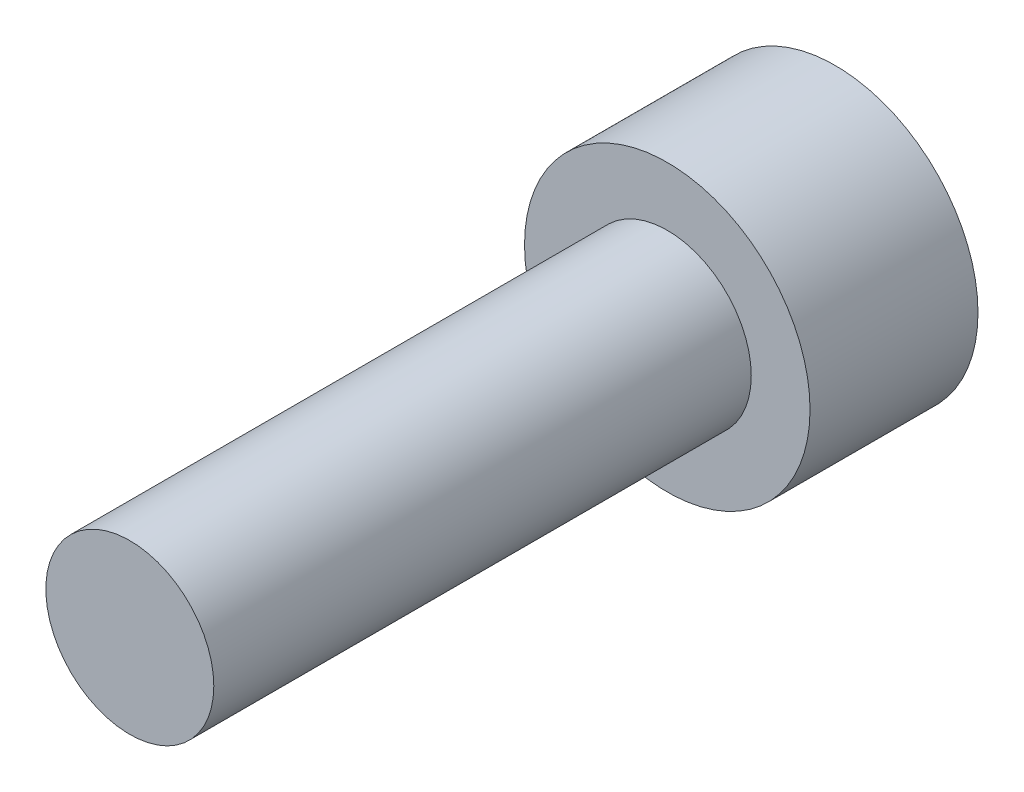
ISO-10303-21;
HEADER;
FILE_DESCRIPTION(('STEP AP214'),'2;1');
FILE_NAME('part.step','',(''),(''),'','','');
FILE_SCHEMA(('AUTOMOTIVE_DESIGN { 1 0 10303 214 1 1 1 1 }'));
ENDSEC;
DATA;
#1=APPLICATION_CONTEXT('core data for automotive mechanical design processes');
#2=APPLICATION_PROTOCOL_DEFINITION('international standard','automotive_design',2000,#1);
#3=PRODUCT_CONTEXT('',#1,'mechanical');
#4=PRODUCT('Part','Part','',(#3));
#5=PRODUCT_RELATED_PRODUCT_CATEGORY('part','',(#4));
#6=PRODUCT_DEFINITION_FORMATION('','',#4);
#7=PRODUCT_DEFINITION_CONTEXT('part definition',#1,'design');
#8=PRODUCT_DEFINITION('design','',#6,#7);
#9=PRODUCT_DEFINITION_SHAPE('','',#8);
#10=(LENGTH_UNIT() NAMED_UNIT(*) SI_UNIT(.MILLI.,.METRE.));
#11=(NAMED_UNIT(*) PLANE_ANGLE_UNIT() SI_UNIT($,.RADIAN.));
#12=(NAMED_UNIT(*) SI_UNIT($,.STERADIAN.) SOLID_ANGLE_UNIT());
#13=UNCERTAINTY_MEASURE_WITH_UNIT(LENGTH_MEASURE(1.E-05),#10,'distance_accuracy_value','');
#14=(GEOMETRIC_REPRESENTATION_CONTEXT(3) GLOBAL_UNCERTAINTY_ASSIGNED_CONTEXT((#13)) GLOBAL_UNIT_ASSIGNED_CONTEXT((#10,
#11,#12)) REPRESENTATION_CONTEXT('',''));
#15=CARTESIAN_POINT('',(0.,0.,0.));
#16=DIRECTION('',(0.,0.,1.));
#17=DIRECTION('',(1.,0.,0.));
#18=AXIS2_PLACEMENT_3D('',#15,#16,#17);
#19=CARTESIAN_POINT('',(0.,0.,16.));
#20=DIRECTION('',(0.,0.,1.));
#21=DIRECTION('',(1.,0.,0.));
#22=AXIS2_PLACEMENT_3D('',#19,#20,#21);
#23=PLANE('',#22);
#24=CARTESIAN_POINT('',(0.,0.,16.));
#25=DIRECTION('',(0.,0.,1.));
#26=DIRECTION('',(1.,0.,0.));
#27=AXIS2_PLACEMENT_3D('',#24,#25,#26);
#28=CIRCLE('',#27,2.5);
#29=CARTESIAN_POINT('',(2.5,0.,16.));
#30=VERTEX_POINT('',#29);
#31=EDGE_CURVE('E11',#30,#30,#28,.T.);
#32=ORIENTED_EDGE('',*,*,#31,.T.);
#33=EDGE_LOOP('',(#32));
#34=FACE_BOUND('',#33,.T.);
#35=ADVANCED_FACE('F32',(#34),#23,.T.);
#36=CARTESIAN_POINT('',(0.,0.,16.));
#37=DIRECTION('',(0.,0.,1.));
#38=DIRECTION('',(1.,0.,0.));
#39=AXIS2_PLACEMENT_3D('',#36,#37,#38);
#40=CYLINDRICAL_SURFACE('',#39,2.5);
#41=CARTESIAN_POINT('',(0.,0.,0.));
#42=DIRECTION('',(0.,0.,1.));
#43=DIRECTION('',(1.,0.,0.));
#44=AXIS2_PLACEMENT_3D('',#41,#42,#43);
#45=CIRCLE('',#44,2.5);
#46=CARTESIAN_POINT('',(2.5,0.,0.));
#47=VERTEX_POINT('',#46);
#48=EDGE_CURVE('E39',#47,#47,#45,.T.);
#49=ORIENTED_EDGE('',*,*,#48,.T.);
#50=EDGE_LOOP('',(#49));
#51=FACE_BOUND('',#50,.T.);
#52=ORIENTED_EDGE('',*,*,#31,.F.);
#53=EDGE_LOOP('',(#52));
#54=FACE_BOUND('',#53,.T.);
#55=ADVANCED_FACE('F146',(#51,#54),#40,.T.);
#56=CARTESIAN_POINT('',(0.,-2.5,0.));
#57=DIRECTION('',(0.,0.,1.));
#58=DIRECTION('',(1.,0.,0.));
#59=AXIS2_PLACEMENT_3D('',#56,#57,#58);
#60=PLANE('',#59);
#61=CARTESIAN_POINT('',(0.,0.,0.));
#62=DIRECTION('',(0.,0.,1.));
#63=DIRECTION('',(1.,0.,0.));
#64=AXIS2_PLACEMENT_3D('',#61,#62,#63);
#65=CIRCLE('',#64,4.25);
#66=CARTESIAN_POINT('',(4.25,0.,0.));
#67=VERTEX_POINT('',#66);
#68=EDGE_CURVE('E141',#67,#67,#65,.T.);
#69=ORIENTED_EDGE('',*,*,#68,.T.);
#70=EDGE_LOOP('',(#69));
#71=FACE_BOUND('',#70,.T.);
#72=ORIENTED_EDGE('',*,*,#48,.F.);
#73=EDGE_LOOP('',(#72));
#74=FACE_BOUND('',#73,.T.);
#75=ADVANCED_FACE('F149',(#71,#74),#60,.T.);
#76=CARTESIAN_POINT('',(0.,0.,16.));
#77=DIRECTION('',(0.,0.,1.));
#78=DIRECTION('',(1.,0.,0.));
#79=AXIS2_PLACEMENT_3D('',#76,#77,#78);
#80=CYLINDRICAL_SURFACE('',#79,4.25);
#81=CARTESIAN_POINT('',(0.,0.,-5.));
#82=DIRECTION('',(0.,0.,1.));
#83=DIRECTION('',(1.,0.,0.));
#84=AXIS2_PLACEMENT_3D('',#81,#82,#83);
#85=CIRCLE('',#84,4.25);
#86=CARTESIAN_POINT('',(4.25,0.,-5.));
#87=VERTEX_POINT('',#86);
#88=EDGE_CURVE('E133',#87,#87,#85,.T.);
#89=ORIENTED_EDGE('',*,*,#88,.T.);
#90=EDGE_LOOP('',(#89));
#91=FACE_BOUND('',#90,.T.);
#92=ORIENTED_EDGE('',*,*,#68,.F.);
#93=EDGE_LOOP('',(#92));
#94=FACE_BOUND('',#93,.T.);
#95=ADVANCED_FACE('F151',(#91,#94),#80,.T.);
#96=CARTESIAN_POINT('',(0.,-4.25,-5.));
#97=DIRECTION('',(0.,0.,-1.));
#98=DIRECTION('',(-1.,0.,0.));
#99=AXIS2_PLACEMENT_3D('',#96,#97,#98);
#100=PLANE('',#99);
#101=DIRECTION('',(0.866025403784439,-0.5,0.));
#102=VECTOR('',#101,1.);
#103=CARTESIAN_POINT('',(0.,2.3094010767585,-5.));
#104=LINE('',#103,#102);
#105=CARTESIAN_POINT('',(0.,2.3094010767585,-5.));
#106=VERTEX_POINT('',#105);
#107=CARTESIAN_POINT('',(2.,1.15470053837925,-5.));
#108=VERTEX_POINT('',#107);
#109=EDGE_CURVE('E46',#106,#108,#104,.T.);
#110=ORIENTED_EDGE('',*,*,#109,.F.);
#111=DIRECTION('',(0.866025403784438,0.5,0.));
#112=VECTOR('',#111,1.);
#113=CARTESIAN_POINT('',(-2.,1.15470053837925,-5.));
#114=LINE('',#113,#112);
#115=CARTESIAN_POINT('',(-2.,1.15470053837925,-5.));
#116=VERTEX_POINT('',#115);
#117=EDGE_CURVE('E129',#116,#106,#114,.T.);
#118=ORIENTED_EDGE('',*,*,#117,.F.);
#119=DIRECTION('',(0.,1.,0.));
#120=VECTOR('',#119,1.);
#121=CARTESIAN_POINT('',(-2.,-1.15470053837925,-5.));
#122=LINE('',#121,#120);
#123=CARTESIAN_POINT('',(-2.,-1.15470053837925,-5.));
#124=VERTEX_POINT('',#123);
#125=EDGE_CURVE('E127',#124,#116,#122,.T.);
#126=ORIENTED_EDGE('',*,*,#125,.F.);
#127=DIRECTION('',(-0.866025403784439,0.5,0.));
#128=VECTOR('',#127,1.);
#129=CARTESIAN_POINT('',(0.,-2.3094010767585,-5.));
#130=LINE('',#129,#128);
#131=CARTESIAN_POINT('',(0.,-2.3094010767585,-5.));
#132=VERTEX_POINT('',#131);
#133=EDGE_CURVE('E94',#132,#124,#130,.T.);
#134=ORIENTED_EDGE('',*,*,#133,.F.);
#135=DIRECTION('',(-0.866025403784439,-0.5,0.));
#136=VECTOR('',#135,1.);
#137=CARTESIAN_POINT('',(2.,-1.15470053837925,-5.));
#138=LINE('',#137,#136);
#139=CARTESIAN_POINT('',(2.,-1.15470053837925,-5.));
#140=VERTEX_POINT('',#139);
#141=EDGE_CURVE('E123',#140,#132,#138,.T.);
#142=ORIENTED_EDGE('',*,*,#141,.F.);
#143=DIRECTION('',(0.,-1.,0.));
#144=VECTOR('',#143,1.);
#145=CARTESIAN_POINT('',(2.,1.15470053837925,-5.));
#146=LINE('',#145,#144);
#147=EDGE_CURVE('E120',#108,#140,#146,.T.);
#148=ORIENTED_EDGE('',*,*,#147,.F.);
#149=EDGE_LOOP('',(#110,#118,#126,#134,#142,#148));
#150=FACE_BOUND('',#149,.T.);
#151=ORIENTED_EDGE('',*,*,#88,.F.);
#152=EDGE_LOOP('',(#151));
#153=FACE_BOUND('',#152,.T.);
#154=ADVANCED_FACE('F158',(#150,#153),#100,.T.);
#155=CARTESIAN_POINT('',(0.,2.3094010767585,-0.999999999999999));
#156=DIRECTION('',(0.5,0.866025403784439,0.));
#157=DIRECTION('',(-0.866025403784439,0.5,0.));
#158=AXIS2_PLACEMENT_3D('',#155,#156,#157);
#159=PLANE('',#158);
#160=ORIENTED_EDGE('',*,*,#109,.T.);
#161=DIRECTION('',(0.,0.,-1.));
#162=VECTOR('',#161,1.);
#163=CARTESIAN_POINT('',(2.,1.15470053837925,-0.999999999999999));
#164=LINE('',#163,#162);
#165=CARTESIAN_POINT('',(2.,1.15470053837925,-0.999999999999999));
#166=VERTEX_POINT('',#165);
#167=EDGE_CURVE('E76',#166,#108,#164,.T.);
#168=ORIENTED_EDGE('',*,*,#167,.F.);
#169=DIRECTION('',(0.866025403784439,-0.5,0.));
#170=VECTOR('',#169,1.);
#171=CARTESIAN_POINT('',(0.,2.3094010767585,-0.999999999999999));
#172=LINE('',#171,#170);
#173=CARTESIAN_POINT('',(0.,2.3094010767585,-0.999999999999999));
#174=VERTEX_POINT('',#173);
#175=EDGE_CURVE('E131',#174,#166,#172,.T.);
#176=ORIENTED_EDGE('',*,*,#175,.F.);
#177=DIRECTION('',(0.,0.,-1.));
#178=VECTOR('',#177,1.);
#179=CARTESIAN_POINT('',(0.,2.3094010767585,-0.999999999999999));
#180=LINE('',#179,#178);
#181=EDGE_CURVE('E54',#174,#106,#180,.T.);
#182=ORIENTED_EDGE('',*,*,#181,.T.);
#183=EDGE_LOOP('',(#160,#168,#176,#182));
#184=FACE_BOUND('',#183,.T.);
#185=ADVANCED_FACE('F189',(#184),#159,.F.);
#186=CARTESIAN_POINT('',(-2.,1.15470053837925,-0.999999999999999));
#187=DIRECTION('',(-0.5,0.866025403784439,0.));
#188=DIRECTION('',(-0.866025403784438,-0.5,0.));
#189=AXIS2_PLACEMENT_3D('',#186,#187,#188);
#190=PLANE('',#189);
#191=ORIENTED_EDGE('',*,*,#117,.T.);
#192=ORIENTED_EDGE('',*,*,#181,.F.);
#193=DIRECTION('',(0.866025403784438,0.5,0.));
#194=VECTOR('',#193,1.);
#195=CARTESIAN_POINT('',(-2.,1.15470053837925,-0.999999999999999));
#196=LINE('',#195,#194);
#197=CARTESIAN_POINT('',(-2.,1.15470053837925,-0.999999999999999));
#198=VERTEX_POINT('',#197);
#199=EDGE_CURVE('E106',#198,#174,#196,.T.);
#200=ORIENTED_EDGE('',*,*,#199,.F.);
#201=DIRECTION('',(0.,0.,-1.));
#202=VECTOR('',#201,1.);
#203=CARTESIAN_POINT('',(-2.,1.15470053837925,-0.999999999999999));
#204=LINE('',#203,#202);
#205=EDGE_CURVE('E98',#198,#116,#204,.T.);
#206=ORIENTED_EDGE('',*,*,#205,.T.);
#207=EDGE_LOOP('',(#191,#192,#200,#206));
#208=FACE_BOUND('',#207,.T.);
#209=ADVANCED_FACE('F199',(#208),#190,.F.);
#210=CARTESIAN_POINT('',(-2.,-1.15470053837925,-0.999999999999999));
#211=DIRECTION('',(-1.,0.,0.));
#212=DIRECTION('',(0.,-1.,0.));
#213=AXIS2_PLACEMENT_3D('',#210,#211,#212);
#214=PLANE('',#213);
#215=ORIENTED_EDGE('',*,*,#125,.T.);
#216=ORIENTED_EDGE('',*,*,#205,.F.);
#217=DIRECTION('',(0.,1.,0.));
#218=VECTOR('',#217,1.);
#219=CARTESIAN_POINT('',(-2.,-1.15470053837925,-0.999999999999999));
#220=LINE('',#219,#218);
#221=CARTESIAN_POINT('',(-2.,-1.15470053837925,-0.999999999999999));
#222=VERTEX_POINT('',#221);
#223=EDGE_CURVE('E102',#222,#198,#220,.T.);
#224=ORIENTED_EDGE('',*,*,#223,.F.);
#225=DIRECTION('',(0.,0.,-1.));
#226=VECTOR('',#225,1.);
#227=CARTESIAN_POINT('',(-2.,-1.15470053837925,-0.999999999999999));
#228=LINE('',#227,#226);
#229=EDGE_CURVE('E87',#222,#124,#228,.T.);
#230=ORIENTED_EDGE('',*,*,#229,.T.);
#231=EDGE_LOOP('',(#215,#216,#224,#230));
#232=FACE_BOUND('',#231,.T.);
#233=ADVANCED_FACE('F103',(#232),#214,.F.);
#234=CARTESIAN_POINT('',(0.,-2.3094010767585,-0.999999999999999));
#235=DIRECTION('',(-0.5,-0.866025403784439,0.));
#236=DIRECTION('',(0.866025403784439,-0.5,0.));
#237=AXIS2_PLACEMENT_3D('',#234,#235,#236);
#238=PLANE('',#237);
#239=ORIENTED_EDGE('',*,*,#133,.T.);
#240=ORIENTED_EDGE('',*,*,#229,.F.);
#241=DIRECTION('',(-0.866025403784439,0.5,0.));
#242=VECTOR('',#241,1.);
#243=CARTESIAN_POINT('',(0.,-2.3094010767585,-0.999999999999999));
#244=LINE('',#243,#242);
#245=CARTESIAN_POINT('',(0.,-2.3094010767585,-0.999999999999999));
#246=VERTEX_POINT('',#245);
#247=EDGE_CURVE('E91',#246,#222,#244,.T.);
#248=ORIENTED_EDGE('',*,*,#247,.F.);
#249=DIRECTION('',(0.,0.,-1.));
#250=VECTOR('',#249,1.);
#251=CARTESIAN_POINT('',(0.,-2.3094010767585,-0.999999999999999));
#252=LINE('',#251,#250);
#253=EDGE_CURVE('E99',#246,#132,#252,.T.);
#254=ORIENTED_EDGE('',*,*,#253,.T.);
#255=EDGE_LOOP('',(#239,#240,#248,#254));
#256=FACE_BOUND('',#255,.T.);
#257=ADVANCED_FACE('F89',(#256),#238,.F.);
#258=CARTESIAN_POINT('',(2.,-1.15470053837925,-0.999999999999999));
#259=DIRECTION('',(0.5,-0.866025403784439,0.));
#260=DIRECTION('',(0.866025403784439,0.5,0.));
#261=AXIS2_PLACEMENT_3D('',#258,#259,#260);
#262=PLANE('',#261);
#263=ORIENTED_EDGE('',*,*,#141,.T.);
#264=ORIENTED_EDGE('',*,*,#253,.F.);
#265=DIRECTION('',(-0.866025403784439,-0.5,0.));
#266=VECTOR('',#265,1.);
#267=CARTESIAN_POINT('',(2.,-1.15470053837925,-0.999999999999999));
#268=LINE('',#267,#266);
#269=CARTESIAN_POINT('',(2.,-1.15470053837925,-0.999999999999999));
#270=VERTEX_POINT('',#269);
#271=EDGE_CURVE('E112',#270,#246,#268,.T.);
#272=ORIENTED_EDGE('',*,*,#271,.F.);
#273=DIRECTION('',(0.,0.,-1.));
#274=VECTOR('',#273,1.);
#275=CARTESIAN_POINT('',(2.,-1.15470053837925,-0.999999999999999));
#276=LINE('',#275,#274);
#277=EDGE_CURVE('E136',#270,#140,#276,.T.);
#278=ORIENTED_EDGE('',*,*,#277,.T.);
#279=EDGE_LOOP('',(#263,#264,#272,#278));
#280=FACE_BOUND('',#279,.T.);
#281=ADVANCED_FACE('F224',(#280),#262,.F.);
#282=CARTESIAN_POINT('',(2.,1.15470053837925,-0.999999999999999));
#283=DIRECTION('',(1.,0.,0.));
#284=DIRECTION('',(0.,0.,-1.));
#285=AXIS2_PLACEMENT_3D('',#282,#283,#284);
#286=PLANE('',#285);
#287=ORIENTED_EDGE('',*,*,#147,.T.);
#288=ORIENTED_EDGE('',*,*,#277,.F.);
#289=DIRECTION('',(0.,-1.,0.));
#290=VECTOR('',#289,1.);
#291=CARTESIAN_POINT('',(2.,1.15470053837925,-0.999999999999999));
#292=LINE('',#291,#290);
#293=EDGE_CURVE('E114',#166,#270,#292,.T.);
#294=ORIENTED_EDGE('',*,*,#293,.F.);
#295=ORIENTED_EDGE('',*,*,#167,.T.);
#296=EDGE_LOOP('',(#287,#288,#294,#295));
#297=FACE_BOUND('',#296,.T.);
#298=ADVANCED_FACE('F233',(#297),#286,.F.);
#299=CARTESIAN_POINT('',(0.,2.3094010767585,-0.999999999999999));
#300=DIRECTION('',(0.,0.,1.));
#301=DIRECTION('',(1.,0.,0.));
#302=AXIS2_PLACEMENT_3D('',#299,#300,#301);
#303=PLANE('',#302);
#304=ORIENTED_EDGE('',*,*,#175,.T.);
#305=ORIENTED_EDGE('',*,*,#293,.T.);
#306=ORIENTED_EDGE('',*,*,#271,.T.);
#307=ORIENTED_EDGE('',*,*,#247,.T.);
#308=ORIENTED_EDGE('',*,*,#223,.T.);
#309=ORIENTED_EDGE('',*,*,#199,.T.);
#310=EDGE_LOOP('',(#304,#305,#306,#307,#308,#309));
#311=FACE_BOUND('',#310,.T.);
#312=ADVANCED_FACE('F109',(#311),#303,.F.);
#313=CLOSED_SHELL('',(#35,#55,#75,#95,#154,#185,#209,#233,#257,#281,#298,#312));
#314=MANIFOLD_SOLID_BREP('B2',#313);
#315=ADVANCED_BREP_SHAPE_REPRESENTATION('',(#18,#314),#14);
#316=SHAPE_DEFINITION_REPRESENTATION(#9,#315);
ENDSEC;
END-ISO-10303-21;
